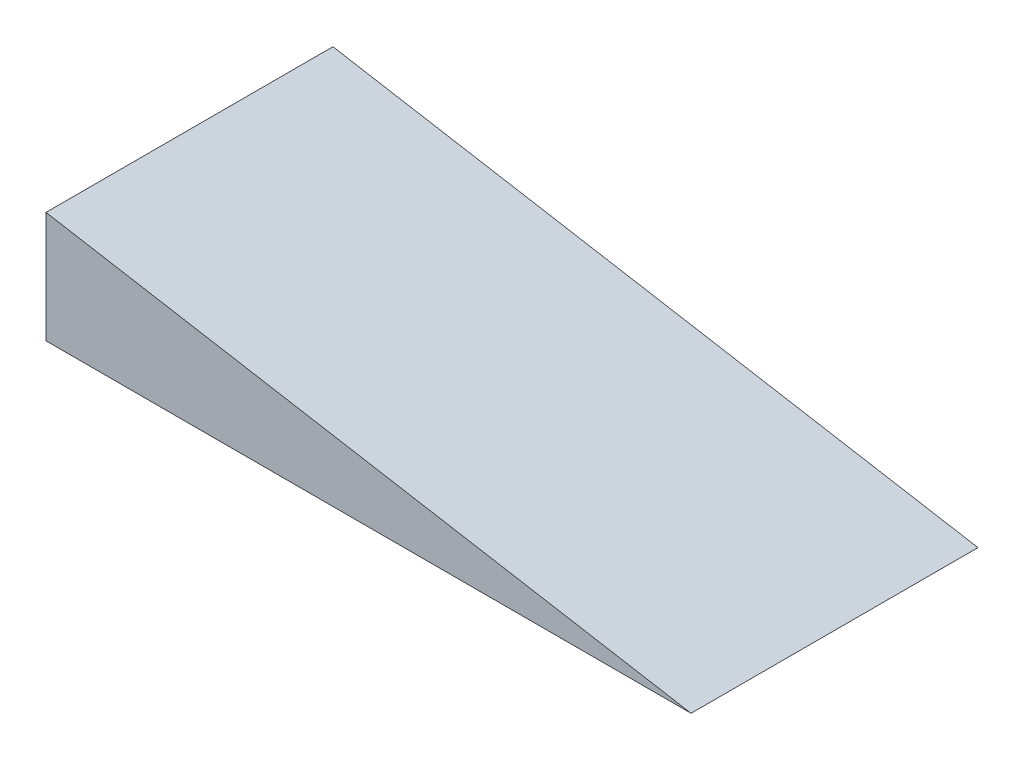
from build123d import *

# Parameters (mm, degrees)
BOSS_EXTRU_3_DEPTH      = 100
BOSS_EXTRU_3_DEPTH_BACK = 159


with BuildPart() as part:
    # Esquisse3 → Boss.-Extru.3 (new, two sides: drawn at the far end of the back side and taken through both)
    with BuildSketch(Plane.XY.offset(-BOSS_EXTRU_3_DEPTH_BACK)):
        Polygon((-141.954262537, -27.194234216), (-141.954262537, 73.245389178), (440.340644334, -27.194234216), align=None)
    extrude(amount=BOSS_EXTRU_3_DEPTH + BOSS_EXTRU_3_DEPTH_BACK)


solid = part.part
